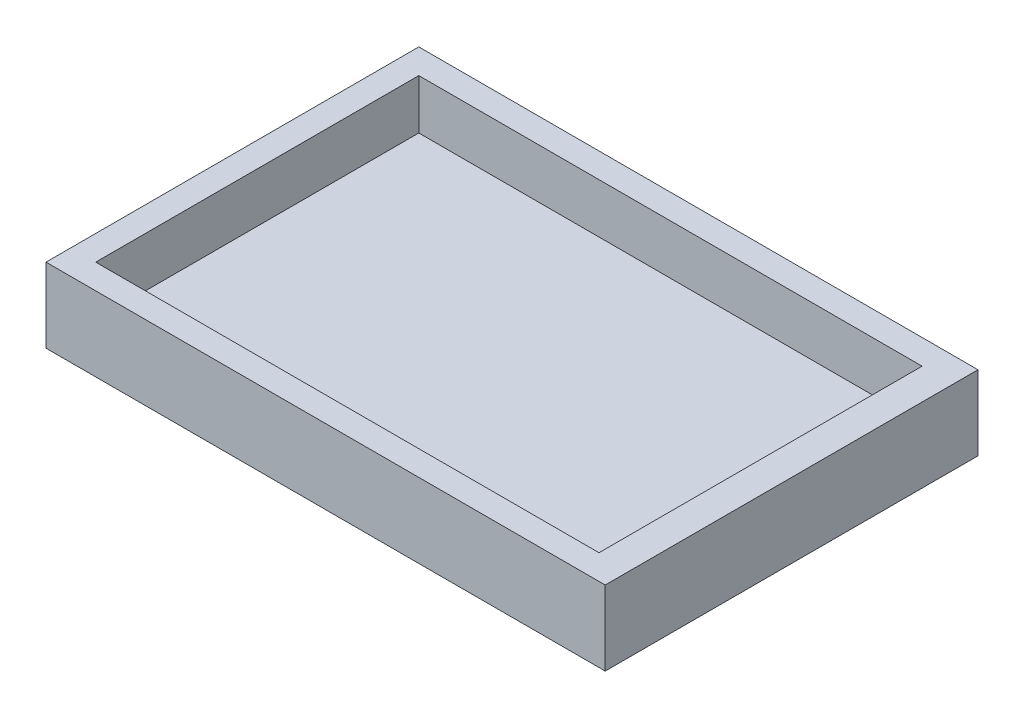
ISO-10303-21;
HEADER;
FILE_DESCRIPTION(('STEP AP214'),'2;1');
FILE_NAME('part.step','',(''),(''),'','','');
FILE_SCHEMA(('AUTOMOTIVE_DESIGN { 1 0 10303 214 1 1 1 1 }'));
ENDSEC;
DATA;
#1=APPLICATION_CONTEXT('core data for automotive mechanical design processes');
#2=APPLICATION_PROTOCOL_DEFINITION('international standard','automotive_design',2000,#1);
#3=PRODUCT_CONTEXT('',#1,'mechanical');
#4=PRODUCT('Part','Part','',(#3));
#5=PRODUCT_RELATED_PRODUCT_CATEGORY('part','',(#4));
#6=PRODUCT_DEFINITION_FORMATION('','',#4);
#7=PRODUCT_DEFINITION_CONTEXT('part definition',#1,'design');
#8=PRODUCT_DEFINITION('design','',#6,#7);
#9=PRODUCT_DEFINITION_SHAPE('','',#8);
#10=(LENGTH_UNIT() NAMED_UNIT(*) SI_UNIT(.MILLI.,.METRE.));
#11=(NAMED_UNIT(*) PLANE_ANGLE_UNIT() SI_UNIT($,.RADIAN.));
#12=(NAMED_UNIT(*) SI_UNIT($,.STERADIAN.) SOLID_ANGLE_UNIT());
#13=UNCERTAINTY_MEASURE_WITH_UNIT(LENGTH_MEASURE(1.E-05),#10,'distance_accuracy_value','');
#14=(GEOMETRIC_REPRESENTATION_CONTEXT(3) GLOBAL_UNCERTAINTY_ASSIGNED_CONTEXT((#13)) GLOBAL_UNIT_ASSIGNED_CONTEXT((#10,
#11,#12)) REPRESENTATION_CONTEXT('',''));
#15=CARTESIAN_POINT('',(0.,0.,0.));
#16=DIRECTION('',(0.,0.,1.));
#17=DIRECTION('',(1.,0.,0.));
#18=AXIS2_PLACEMENT_3D('',#15,#16,#17);
#19=CARTESIAN_POINT('',(0.,30.,0.));
#20=DIRECTION('',(0.,1.,0.));
#21=DIRECTION('',(0.,0.,1.));
#22=AXIS2_PLACEMENT_3D('',#19,#20,#21);
#23=PLANE('',#22);
#24=DIRECTION('',(0.,0.,1.));
#25=VECTOR('',#24,1.);
#26=CARTESIAN_POINT('',(0.,30.,0.));
#27=LINE('',#26,#25);
#28=CARTESIAN_POINT('',(0.,30.,0.));
#29=VERTEX_POINT('',#28);
#30=CARTESIAN_POINT('',(0.,30.,150.));
#31=VERTEX_POINT('',#30);
#32=EDGE_CURVE('E153',#29,#31,#27,.T.);
#33=ORIENTED_EDGE('',*,*,#32,.T.);
#34=DIRECTION('',(1.,0.,0.));
#35=VECTOR('',#34,1.);
#36=CARTESIAN_POINT('',(0.,30.,150.));
#37=LINE('',#36,#35);
#38=CARTESIAN_POINT('',(225.,30.,150.));
#39=VERTEX_POINT('',#38);
#40=EDGE_CURVE('E92',#31,#39,#37,.T.);
#41=ORIENTED_EDGE('',*,*,#40,.T.);
#42=DIRECTION('',(0.,0.,-1.));
#43=VECTOR('',#42,1.);
#44=CARTESIAN_POINT('',(225.,30.,0.));
#45=LINE('',#44,#43);
#46=CARTESIAN_POINT('',(225.,30.,0.));
#47=VERTEX_POINT('',#46);
#48=EDGE_CURVE('E158',#39,#47,#45,.T.);
#49=ORIENTED_EDGE('',*,*,#48,.T.);
#50=DIRECTION('',(-1.,0.,0.));
#51=VECTOR('',#50,1.);
#52=CARTESIAN_POINT('',(0.,30.,0.));
#53=LINE('',#52,#51);
#54=EDGE_CURVE('E63',#47,#29,#53,.T.);
#55=ORIENTED_EDGE('',*,*,#54,.T.);
#56=EDGE_LOOP('',(#33,#41,#49,#55));
#57=FACE_BOUND('',#56,.T.);
#58=DIRECTION('',(0.,0.,1.));
#59=VECTOR('',#58,1.);
#60=CARTESIAN_POINT('',(212.5,30.,0.));
#61=LINE('',#60,#59);
#62=CARTESIAN_POINT('',(212.5,30.,10.));
#63=VERTEX_POINT('',#62);
#64=CARTESIAN_POINT('',(212.5,30.,140.));
#65=VERTEX_POINT('',#64);
#66=EDGE_CURVE('E47',#63,#65,#61,.T.);
#67=ORIENTED_EDGE('',*,*,#66,.T.);
#68=DIRECTION('',(-1.,0.,0.));
#69=VECTOR('',#68,1.);
#70=CARTESIAN_POINT('',(0.,30.,140.));
#71=LINE('',#70,#69);
#72=CARTESIAN_POINT('',(10.,30.,140.));
#73=VERTEX_POINT('',#72);
#74=EDGE_CURVE('E11',#65,#73,#71,.T.);
#75=ORIENTED_EDGE('',*,*,#74,.T.);
#76=DIRECTION('',(0.,0.,-1.));
#77=VECTOR('',#76,1.);
#78=CARTESIAN_POINT('',(10.,30.,0.));
#79=LINE('',#78,#77);
#80=CARTESIAN_POINT('',(10.,30.,10.));
#81=VERTEX_POINT('',#80);
#82=EDGE_CURVE('E187',#73,#81,#79,.T.);
#83=ORIENTED_EDGE('',*,*,#82,.T.);
#84=DIRECTION('',(1.,0.,0.));
#85=VECTOR('',#84,1.);
#86=CARTESIAN_POINT('',(0.,30.,10.));
#87=LINE('',#86,#85);
#88=EDGE_CURVE('E191',#81,#63,#87,.T.);
#89=ORIENTED_EDGE('',*,*,#88,.T.);
#90=EDGE_LOOP('',(#67,#75,#83,#89));
#91=FACE_BOUND('',#90,.T.);
#92=ADVANCED_FACE('F38',(#57,#91),#23,.T.);
#93=CARTESIAN_POINT('',(0.,30.,0.));
#94=DIRECTION('',(1.,0.,0.));
#95=DIRECTION('',(0.,0.,-1.));
#96=AXIS2_PLACEMENT_3D('',#93,#94,#95);
#97=PLANE('',#96);
#98=DIRECTION('',(0.,0.,1.));
#99=VECTOR('',#98,1.);
#100=CARTESIAN_POINT('',(0.,0.,0.));
#101=LINE('',#100,#99);
#102=CARTESIAN_POINT('',(0.,0.,0.));
#103=VERTEX_POINT('',#102);
#104=CARTESIAN_POINT('',(0.,0.,150.));
#105=VERTEX_POINT('',#104);
#106=EDGE_CURVE('E124',#103,#105,#101,.T.);
#107=ORIENTED_EDGE('',*,*,#106,.T.);
#108=DIRECTION('',(0.,-1.,0.));
#109=VECTOR('',#108,1.);
#110=CARTESIAN_POINT('',(0.,30.,150.));
#111=LINE('',#110,#109);
#112=EDGE_CURVE('E184',#31,#105,#111,.T.);
#113=ORIENTED_EDGE('',*,*,#112,.F.);
#114=ORIENTED_EDGE('',*,*,#32,.F.);
#115=DIRECTION('',(0.,-1.,0.));
#116=VECTOR('',#115,1.);
#117=CARTESIAN_POINT('',(0.,30.,0.));
#118=LINE('',#117,#116);
#119=EDGE_CURVE('E163',#29,#103,#118,.T.);
#120=ORIENTED_EDGE('',*,*,#119,.T.);
#121=EDGE_LOOP('',(#107,#113,#114,#120));
#122=FACE_BOUND('',#121,.T.);
#123=ADVANCED_FACE('F40',(#122),#97,.F.);
#124=CARTESIAN_POINT('',(0.,30.,150.));
#125=DIRECTION('',(0.,0.,-1.));
#126=DIRECTION('',(-1.,0.,0.));
#127=AXIS2_PLACEMENT_3D('',#124,#125,#126);
#128=PLANE('',#127);
#129=DIRECTION('',(1.,0.,0.));
#130=VECTOR('',#129,1.);
#131=CARTESIAN_POINT('',(0.,0.,150.));
#132=LINE('',#131,#130);
#133=CARTESIAN_POINT('',(225.,0.,150.));
#134=VERTEX_POINT('',#133);
#135=EDGE_CURVE('E167',#105,#134,#132,.T.);
#136=ORIENTED_EDGE('',*,*,#135,.T.);
#137=DIRECTION('',(0.,-1.,0.));
#138=VECTOR('',#137,1.);
#139=CARTESIAN_POINT('',(225.,30.,150.));
#140=LINE('',#139,#138);
#141=EDGE_CURVE('E180',#39,#134,#140,.T.);
#142=ORIENTED_EDGE('',*,*,#141,.F.);
#143=ORIENTED_EDGE('',*,*,#40,.F.);
#144=ORIENTED_EDGE('',*,*,#112,.T.);
#145=EDGE_LOOP('',(#136,#142,#143,#144));
#146=FACE_BOUND('',#145,.T.);
#147=ADVANCED_FACE('F214',(#146),#128,.F.);
#148=CARTESIAN_POINT('',(225.,30.,0.));
#149=DIRECTION('',(-1.,0.,0.));
#150=DIRECTION('',(0.,0.,1.));
#151=AXIS2_PLACEMENT_3D('',#148,#149,#150);
#152=PLANE('',#151);
#153=DIRECTION('',(0.,0.,-1.));
#154=VECTOR('',#153,1.);
#155=CARTESIAN_POINT('',(225.,0.,0.));
#156=LINE('',#155,#154);
#157=CARTESIAN_POINT('',(225.,0.,0.));
#158=VERTEX_POINT('',#157);
#159=EDGE_CURVE('E170',#134,#158,#156,.T.);
#160=ORIENTED_EDGE('',*,*,#159,.T.);
#161=DIRECTION('',(0.,-1.,0.));
#162=VECTOR('',#161,1.);
#163=CARTESIAN_POINT('',(225.,30.,0.));
#164=LINE('',#163,#162);
#165=EDGE_CURVE('E177',#47,#158,#164,.T.);
#166=ORIENTED_EDGE('',*,*,#165,.F.);
#167=ORIENTED_EDGE('',*,*,#48,.F.);
#168=ORIENTED_EDGE('',*,*,#141,.T.);
#169=EDGE_LOOP('',(#160,#166,#167,#168));
#170=FACE_BOUND('',#169,.T.);
#171=ADVANCED_FACE('F226',(#170),#152,.F.);
#172=CARTESIAN_POINT('',(0.,30.,0.));
#173=DIRECTION('',(0.,0.,1.));
#174=DIRECTION('',(1.,0.,0.));
#175=AXIS2_PLACEMENT_3D('',#172,#173,#174);
#176=PLANE('',#175);
#177=DIRECTION('',(-1.,0.,0.));
#178=VECTOR('',#177,1.);
#179=CARTESIAN_POINT('',(0.,0.,0.));
#180=LINE('',#179,#178);
#181=EDGE_CURVE('E84',#158,#103,#180,.T.);
#182=ORIENTED_EDGE('',*,*,#181,.T.);
#183=ORIENTED_EDGE('',*,*,#119,.F.);
#184=ORIENTED_EDGE('',*,*,#54,.F.);
#185=ORIENTED_EDGE('',*,*,#165,.T.);
#186=EDGE_LOOP('',(#182,#183,#184,#185));
#187=FACE_BOUND('',#186,.T.);
#188=ADVANCED_FACE('F222',(#187),#176,.F.);
#189=CARTESIAN_POINT('',(0.,0.,0.));
#190=DIRECTION('',(0.,1.,0.));
#191=DIRECTION('',(0.,0.,1.));
#192=AXIS2_PLACEMENT_3D('',#189,#190,#191);
#193=PLANE('',#192);
#194=ORIENTED_EDGE('',*,*,#106,.F.);
#195=ORIENTED_EDGE('',*,*,#181,.F.);
#196=ORIENTED_EDGE('',*,*,#159,.F.);
#197=ORIENTED_EDGE('',*,*,#135,.F.);
#198=EDGE_LOOP('',(#194,#195,#196,#197));
#199=FACE_BOUND('',#198,.T.);
#200=ADVANCED_FACE('F219',(#199),#193,.F.);
#201=CARTESIAN_POINT('',(10.,50.,140.));
#202=DIRECTION('',(0.,0.,-1.));
#203=DIRECTION('',(-1.,0.,0.));
#204=AXIS2_PLACEMENT_3D('',#201,#202,#203);
#205=PLANE('',#204);
#206=DIRECTION('',(0.,-1.,0.));
#207=VECTOR('',#206,1.);
#208=CARTESIAN_POINT('',(212.5,50.,140.));
#209=LINE('',#208,#207);
#210=CARTESIAN_POINT('',(212.5,10.,140.));
#211=VERTEX_POINT('',#210);
#212=EDGE_CURVE('E114',#65,#211,#209,.T.);
#213=ORIENTED_EDGE('',*,*,#212,.T.);
#214=DIRECTION('',(1.,0.,0.));
#215=VECTOR('',#214,1.);
#216=CARTESIAN_POINT('',(10.,10.,140.));
#217=LINE('',#216,#215);
#218=CARTESIAN_POINT('',(10.,10.,140.));
#219=VERTEX_POINT('',#218);
#220=EDGE_CURVE('E119',#219,#211,#217,.T.);
#221=ORIENTED_EDGE('',*,*,#220,.F.);
#222=DIRECTION('',(0.,-1.,0.));
#223=VECTOR('',#222,1.);
#224=CARTESIAN_POINT('',(10.,50.,140.));
#225=LINE('',#224,#223);
#226=EDGE_CURVE('E146',#73,#219,#225,.T.);
#227=ORIENTED_EDGE('',*,*,#226,.F.);
#228=ORIENTED_EDGE('',*,*,#74,.F.);
#229=EDGE_LOOP('',(#213,#221,#227,#228));
#230=FACE_BOUND('',#229,.T.);
#231=ADVANCED_FACE('F116',(#230),#205,.T.);
#232=CARTESIAN_POINT('',(212.5,50.,140.));
#233=DIRECTION('',(-1.,0.,0.));
#234=DIRECTION('',(0.,0.,1.));
#235=AXIS2_PLACEMENT_3D('',#232,#233,#234);
#236=PLANE('',#235);
#237=DIRECTION('',(0.,-1.,0.));
#238=VECTOR('',#237,1.);
#239=CARTESIAN_POINT('',(212.5,50.,10.));
#240=LINE('',#239,#238);
#241=CARTESIAN_POINT('',(212.5,10.,10.));
#242=VERTEX_POINT('',#241);
#243=EDGE_CURVE('E125',#63,#242,#240,.T.);
#244=ORIENTED_EDGE('',*,*,#243,.T.);
#245=DIRECTION('',(0.,0.,-1.));
#246=VECTOR('',#245,1.);
#247=CARTESIAN_POINT('',(212.5,10.,140.));
#248=LINE('',#247,#246);
#249=EDGE_CURVE('E128',#211,#242,#248,.T.);
#250=ORIENTED_EDGE('',*,*,#249,.F.);
#251=ORIENTED_EDGE('',*,*,#212,.F.);
#252=ORIENTED_EDGE('',*,*,#66,.F.);
#253=EDGE_LOOP('',(#244,#250,#251,#252));
#254=FACE_BOUND('',#253,.T.);
#255=ADVANCED_FACE('F129',(#254),#236,.T.);
#256=CARTESIAN_POINT('',(212.5,50.,10.));
#257=DIRECTION('',(0.,0.,1.));
#258=DIRECTION('',(1.,0.,0.));
#259=AXIS2_PLACEMENT_3D('',#256,#257,#258);
#260=PLANE('',#259);
#261=DIRECTION('',(0.,-1.,0.));
#262=VECTOR('',#261,1.);
#263=CARTESIAN_POINT('',(10.,50.,10.));
#264=LINE('',#263,#262);
#265=CARTESIAN_POINT('',(10.,10.,10.));
#266=VERTEX_POINT('',#265);
#267=EDGE_CURVE('E54',#81,#266,#264,.T.);
#268=ORIENTED_EDGE('',*,*,#267,.T.);
#269=DIRECTION('',(-1.,0.,0.));
#270=VECTOR('',#269,1.);
#271=CARTESIAN_POINT('',(212.5,10.,10.));
#272=LINE('',#271,#270);
#273=EDGE_CURVE('E135',#242,#266,#272,.T.);
#274=ORIENTED_EDGE('',*,*,#273,.F.);
#275=ORIENTED_EDGE('',*,*,#243,.F.);
#276=ORIENTED_EDGE('',*,*,#88,.F.);
#277=EDGE_LOOP('',(#268,#274,#275,#276));
#278=FACE_BOUND('',#277,.T.);
#279=ADVANCED_FACE('F197',(#278),#260,.T.);
#280=CARTESIAN_POINT('',(10.,50.,140.));
#281=DIRECTION('',(1.,0.,0.));
#282=DIRECTION('',(0.,0.,-1.));
#283=AXIS2_PLACEMENT_3D('',#280,#281,#282);
#284=PLANE('',#283);
#285=ORIENTED_EDGE('',*,*,#226,.T.);
#286=DIRECTION('',(0.,0.,1.));
#287=VECTOR('',#286,1.);
#288=CARTESIAN_POINT('',(10.,10.,140.));
#289=LINE('',#288,#287);
#290=EDGE_CURVE('E138',#266,#219,#289,.T.);
#291=ORIENTED_EDGE('',*,*,#290,.F.);
#292=ORIENTED_EDGE('',*,*,#267,.F.);
#293=ORIENTED_EDGE('',*,*,#82,.F.);
#294=EDGE_LOOP('',(#285,#291,#292,#293));
#295=FACE_BOUND('',#294,.T.);
#296=ADVANCED_FACE('F198',(#295),#284,.T.);
#297=CARTESIAN_POINT('',(0.,10.,0.));
#298=DIRECTION('',(0.,1.,0.));
#299=DIRECTION('',(0.,0.,1.));
#300=AXIS2_PLACEMENT_3D('',#297,#298,#299);
#301=PLANE('',#300);
#302=ORIENTED_EDGE('',*,*,#220,.T.);
#303=ORIENTED_EDGE('',*,*,#249,.T.);
#304=ORIENTED_EDGE('',*,*,#273,.T.);
#305=ORIENTED_EDGE('',*,*,#290,.T.);
#306=EDGE_LOOP('',(#302,#303,#304,#305));
#307=FACE_BOUND('',#306,.T.);
#308=ADVANCED_FACE('F137',(#307),#301,.T.);
#309=CLOSED_SHELL('',(#92,#123,#147,#171,#188,#200,#231,#255,#279,#296,#308));
#310=MANIFOLD_SOLID_BREP('B2',#309);
#311=ADVANCED_BREP_SHAPE_REPRESENTATION('',(#18,#310),#14);
#312=SHAPE_DEFINITION_REPRESENTATION(#9,#311);
ENDSEC;
END-ISO-10303-21;
